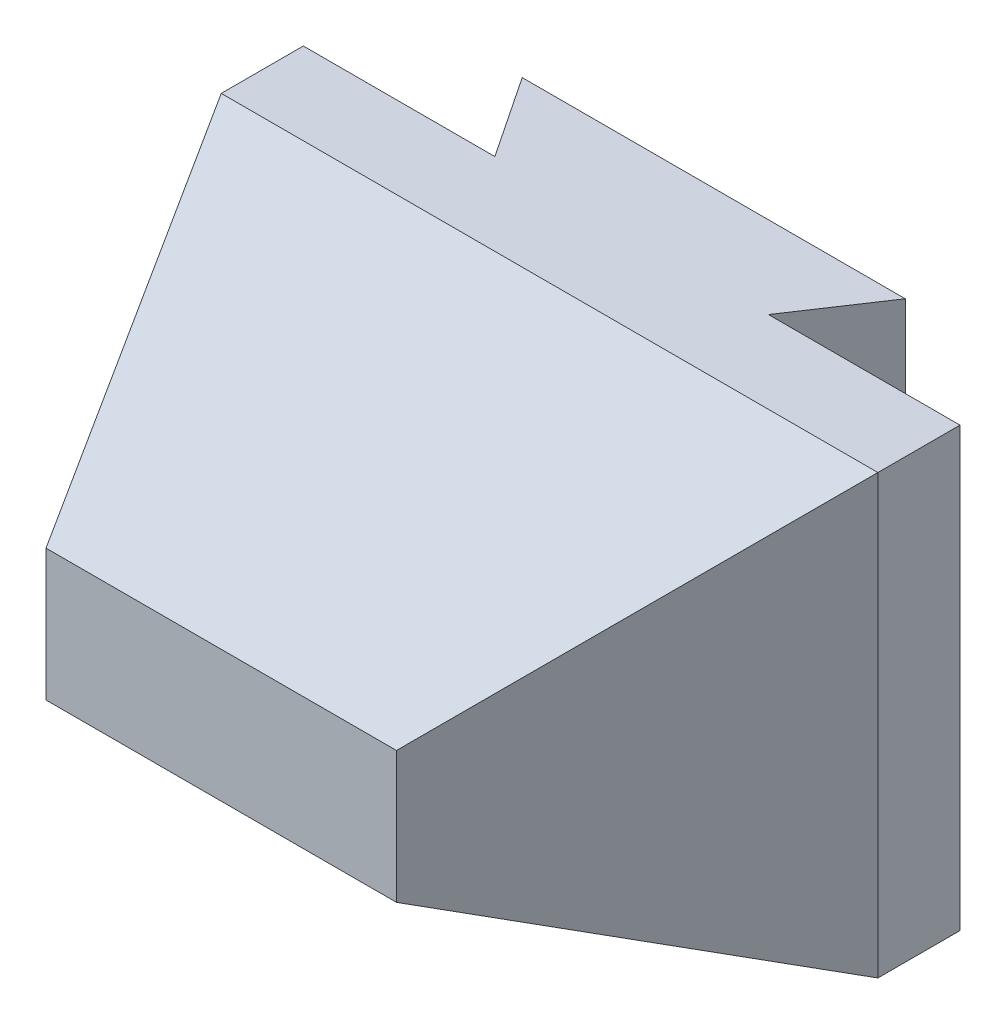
ISO-10303-21;
HEADER;
FILE_DESCRIPTION(('STEP AP214'),'2;1');
FILE_NAME('part.step','',(''),(''),'','','');
FILE_SCHEMA(('AUTOMOTIVE_DESIGN { 1 0 10303 214 1 1 1 1 }'));
ENDSEC;
DATA;
#1=APPLICATION_CONTEXT('core data for automotive mechanical design processes');
#2=APPLICATION_PROTOCOL_DEFINITION('international standard','automotive_design',2000,#1);
#3=PRODUCT_CONTEXT('',#1,'mechanical');
#4=PRODUCT('Part','Part','',(#3));
#5=PRODUCT_RELATED_PRODUCT_CATEGORY('part','',(#4));
#6=PRODUCT_DEFINITION_FORMATION('','',#4);
#7=PRODUCT_DEFINITION_CONTEXT('part definition',#1,'design');
#8=PRODUCT_DEFINITION('design','',#6,#7);
#9=PRODUCT_DEFINITION_SHAPE('','',#8);
#10=(LENGTH_UNIT() NAMED_UNIT(*) SI_UNIT(.MILLI.,.METRE.));
#11=(NAMED_UNIT(*) PLANE_ANGLE_UNIT() SI_UNIT($,.RADIAN.));
#12=(NAMED_UNIT(*) SI_UNIT($,.STERADIAN.) SOLID_ANGLE_UNIT());
#13=UNCERTAINTY_MEASURE_WITH_UNIT(LENGTH_MEASURE(1.E-05),#10,'distance_accuracy_value','');
#14=(GEOMETRIC_REPRESENTATION_CONTEXT(3) GLOBAL_UNCERTAINTY_ASSIGNED_CONTEXT((#13)) GLOBAL_UNIT_ASSIGNED_CONTEXT((#10,
#11,#12)) REPRESENTATION_CONTEXT('',''));
#15=CARTESIAN_POINT('',(0.,0.,0.));
#16=DIRECTION('',(0.,0.,1.));
#17=DIRECTION('',(1.,0.,0.));
#18=AXIS2_PLACEMENT_3D('',#15,#16,#17);
#19=CARTESIAN_POINT('',(60.,-40.,-30.));
#20=DIRECTION('',(0.,1.,0.));
#21=DIRECTION('',(-1.,0.,0.));
#22=AXIS2_PLACEMENT_3D('',#19,#20,#21);
#23=PLANE('',#22);
#24=DIRECTION('',(-1.,0.,0.));
#25=VECTOR('',#24,1.);
#26=CARTESIAN_POINT('',(60.,-40.0000000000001,-15.));
#27=LINE('',#26,#25);
#28=CARTESIAN_POINT('',(60.,-40.0000000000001,-15.));
#29=VERTEX_POINT('',#28);
#30=CARTESIAN_POINT('',(25.,-40.,-15.));
#31=VERTEX_POINT('',#30);
#32=EDGE_CURVE('E111',#29,#31,#27,.T.);
#33=ORIENTED_EDGE('',*,*,#32,.F.);
#34=DIRECTION('',(0.,0.,1.));
#35=VECTOR('',#34,1.);
#36=CARTESIAN_POINT('',(60.,-40.,-30.));
#37=LINE('',#36,#35);
#38=CARTESIAN_POINT('',(60.,-40.,0.));
#39=VERTEX_POINT('',#38);
#40=EDGE_CURVE('E155',#29,#39,#37,.T.);
#41=ORIENTED_EDGE('',*,*,#40,.T.);
#42=DIRECTION('',(1.,0.,0.));
#43=VECTOR('',#42,1.);
#44=CARTESIAN_POINT('',(-60.,-40.,0.));
#45=LINE('',#44,#43);
#46=CARTESIAN_POINT('',(-60.,-40.,0.));
#47=VERTEX_POINT('',#46);
#48=EDGE_CURVE('E166',#47,#39,#45,.T.);
#49=ORIENTED_EDGE('',*,*,#48,.F.);
#50=DIRECTION('',(0.,0.,1.));
#51=VECTOR('',#50,1.);
#52=CARTESIAN_POINT('',(-60.,-40.,-30.));
#53=LINE('',#52,#51);
#54=CARTESIAN_POINT('',(-60.,-40.,-15.));
#55=VERTEX_POINT('',#54);
#56=EDGE_CURVE('E161',#55,#47,#53,.T.);
#57=ORIENTED_EDGE('',*,*,#56,.F.);
#58=DIRECTION('',(1.,0.,0.));
#59=VECTOR('',#58,1.);
#60=CARTESIAN_POINT('',(-60.,-40.,-15.));
#61=LINE('',#60,#59);
#62=CARTESIAN_POINT('',(-25.,-40.,-15.));
#63=VERTEX_POINT('',#62);
#64=EDGE_CURVE('E137',#55,#63,#61,.T.);
#65=ORIENTED_EDGE('',*,*,#64,.T.);
#66=DIRECTION('',(-0.554700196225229,0.,-0.832050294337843));
#67=VECTOR('',#66,1.);
#68=CARTESIAN_POINT('',(-25.,-40.,-15.));
#69=LINE('',#68,#67);
#70=CARTESIAN_POINT('',(-35.,-40.,-30.));
#71=VERTEX_POINT('',#70);
#72=EDGE_CURVE('E140',#63,#71,#69,.T.);
#73=ORIENTED_EDGE('',*,*,#72,.T.);
#74=DIRECTION('',(-1.,0.,0.));
#75=VECTOR('',#74,1.);
#76=CARTESIAN_POINT('',(60.,-40.,-30.));
#77=LINE('',#76,#75);
#78=CARTESIAN_POINT('',(35.,-40.,-30.));
#79=VERTEX_POINT('',#78);
#80=EDGE_CURVE('E128',#79,#71,#77,.T.);
#81=ORIENTED_EDGE('',*,*,#80,.F.);
#82=DIRECTION('',(0.554700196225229,0.,-0.832050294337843));
#83=VECTOR('',#82,1.);
#84=CARTESIAN_POINT('',(25.,-40.,-15.));
#85=LINE('',#84,#83);
#86=EDGE_CURVE('E48',#31,#79,#85,.T.);
#87=ORIENTED_EDGE('',*,*,#86,.F.);
#88=EDGE_LOOP('',(#33,#41,#49,#57,#65,#73,#81,#87));
#89=FACE_BOUND('',#88,.T.);
#90=ADVANCED_FACE('F31',(#89),#23,.F.);
#91=CARTESIAN_POINT('',(-60.,40.,-30.));
#92=DIRECTION('',(0.,-1.,0.));
#93=DIRECTION('',(1.,0.,0.));
#94=AXIS2_PLACEMENT_3D('',#91,#92,#93);
#95=PLANE('',#94);
#96=DIRECTION('',(-1.,0.,0.));
#97=VECTOR('',#96,1.);
#98=CARTESIAN_POINT('',(60.,40.,-15.));
#99=LINE('',#98,#97);
#100=CARTESIAN_POINT('',(60.,40.,-15.));
#101=VERTEX_POINT('',#100);
#102=CARTESIAN_POINT('',(25.,40.,-15.));
#103=VERTEX_POINT('',#102);
#104=EDGE_CURVE('E129',#101,#103,#99,.T.);
#105=ORIENTED_EDGE('',*,*,#104,.T.);
#106=DIRECTION('',(0.554700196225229,0.,-0.832050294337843));
#107=VECTOR('',#106,1.);
#108=CARTESIAN_POINT('',(25.,40.,-15.));
#109=LINE('',#108,#107);
#110=CARTESIAN_POINT('',(35.,40.,-30.));
#111=VERTEX_POINT('',#110);
#112=EDGE_CURVE('E123',#103,#111,#109,.T.);
#113=ORIENTED_EDGE('',*,*,#112,.T.);
#114=DIRECTION('',(1.,0.,0.));
#115=VECTOR('',#114,1.);
#116=CARTESIAN_POINT('',(-60.,40.,-30.));
#117=LINE('',#116,#115);
#118=CARTESIAN_POINT('',(-35.,40.,-30.));
#119=VERTEX_POINT('',#118);
#120=EDGE_CURVE('E152',#119,#111,#117,.T.);
#121=ORIENTED_EDGE('',*,*,#120,.F.);
#122=DIRECTION('',(-0.554700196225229,0.,-0.832050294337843));
#123=VECTOR('',#122,1.);
#124=CARTESIAN_POINT('',(-25.,40.,-15.));
#125=LINE('',#124,#123);
#126=CARTESIAN_POINT('',(-25.,40.,-15.));
#127=VERTEX_POINT('',#126);
#128=EDGE_CURVE('E56',#127,#119,#125,.T.);
#129=ORIENTED_EDGE('',*,*,#128,.F.);
#130=DIRECTION('',(1.,0.,0.));
#131=VECTOR('',#130,1.);
#132=CARTESIAN_POINT('',(-60.,40.,-15.));
#133=LINE('',#132,#131);
#134=CARTESIAN_POINT('',(-60.,40.,-15.));
#135=VERTEX_POINT('',#134);
#136=EDGE_CURVE('E134',#135,#127,#133,.T.);
#137=ORIENTED_EDGE('',*,*,#136,.F.);
#138=DIRECTION('',(0.,0.,1.));
#139=VECTOR('',#138,1.);
#140=CARTESIAN_POINT('',(-60.,40.,-30.));
#141=LINE('',#140,#139);
#142=CARTESIAN_POINT('',(-60.,40.,0.));
#143=VERTEX_POINT('',#142);
#144=EDGE_CURVE('E159',#135,#143,#141,.T.);
#145=ORIENTED_EDGE('',*,*,#144,.T.);
#146=DIRECTION('',(-1.,0.,0.));
#147=VECTOR('',#146,1.);
#148=CARTESIAN_POINT('',(-60.,40.,0.));
#149=LINE('',#148,#147);
#150=CARTESIAN_POINT('',(60.,40.,0.));
#151=VERTEX_POINT('',#150);
#152=EDGE_CURVE('E172',#151,#143,#149,.T.);
#153=ORIENTED_EDGE('',*,*,#152,.F.);
#154=DIRECTION('',(0.,0.,1.));
#155=VECTOR('',#154,1.);
#156=CARTESIAN_POINT('',(60.,40.,-30.));
#157=LINE('',#156,#155);
#158=EDGE_CURVE('E157',#101,#151,#157,.T.);
#159=ORIENTED_EDGE('',*,*,#158,.F.);
#160=EDGE_LOOP('',(#105,#113,#121,#129,#137,#145,#153,#159));
#161=FACE_BOUND('',#160,.T.);
#162=ADVANCED_FACE('F212',(#161),#95,.F.);
#163=CARTESIAN_POINT('',(60.,40.,-30.));
#164=DIRECTION('',(-1.,0.,0.));
#165=DIRECTION('',(0.,0.,1.));
#166=AXIS2_PLACEMENT_3D('',#163,#164,#165);
#167=PLANE('',#166);
#168=DIRECTION('',(0.,1.,0.));
#169=VECTOR('',#168,1.);
#170=CARTESIAN_POINT('',(60.,-40.0000000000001,-15.));
#171=LINE('',#170,#169);
#172=EDGE_CURVE('E116',#29,#101,#171,.T.);
#173=ORIENTED_EDGE('',*,*,#172,.T.);
#174=ORIENTED_EDGE('',*,*,#158,.T.);
#175=DIRECTION('',(0.,1.,0.));
#176=VECTOR('',#175,1.);
#177=CARTESIAN_POINT('',(60.,40.,0.));
#178=LINE('',#177,#176);
#179=EDGE_CURVE('E169',#39,#151,#178,.T.);
#180=ORIENTED_EDGE('',*,*,#179,.F.);
#181=ORIENTED_EDGE('',*,*,#40,.F.);
#182=EDGE_LOOP('',(#173,#174,#180,#181));
#183=FACE_BOUND('',#182,.T.);
#184=ADVANCED_FACE('F209',(#183),#167,.F.);
#185=CARTESIAN_POINT('',(-60.,-40.,-30.));
#186=DIRECTION('',(0.,0.,-1.));
#187=DIRECTION('',(-1.,0.,0.));
#188=AXIS2_PLACEMENT_3D('',#185,#186,#187);
#189=PLANE('',#188);
#190=ORIENTED_EDGE('',*,*,#120,.T.);
#191=DIRECTION('',(0.,1.,0.));
#192=VECTOR('',#191,1.);
#193=CARTESIAN_POINT('',(35.,-40.,-30.));
#194=LINE('',#193,#192);
#195=EDGE_CURVE('E119',#79,#111,#194,.T.);
#196=ORIENTED_EDGE('',*,*,#195,.F.);
#197=ORIENTED_EDGE('',*,*,#80,.T.);
#198=DIRECTION('',(0.,1.,0.));
#199=VECTOR('',#198,1.);
#200=CARTESIAN_POINT('',(-35.,-40.,-30.));
#201=LINE('',#200,#199);
#202=EDGE_CURVE('E146',#71,#119,#201,.T.);
#203=ORIENTED_EDGE('',*,*,#202,.T.);
#204=EDGE_LOOP('',(#190,#196,#197,#203));
#205=FACE_BOUND('',#204,.T.);
#206=ADVANCED_FACE('F225',(#205),#189,.T.);
#207=CARTESIAN_POINT('',(-60.,40.,0.));
#208=DIRECTION('',(-0.90630778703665,0.,0.4226182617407));
#209=DIRECTION('',(0.4226182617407,0.,0.90630778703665));
#210=AXIS2_PLACEMENT_3D('',#207,#208,#209);
#211=PLANE('',#210);
#212=DIRECTION('',(0.,-1.,0.));
#213=VECTOR('',#212,1.);
#214=CARTESIAN_POINT('',(-60.,40.,0.));
#215=LINE('',#214,#213);
#216=EDGE_CURVE('E163',#143,#47,#215,.T.);
#217=ORIENTED_EDGE('',*,*,#216,.T.);
#218=DIRECTION('',(-0.389281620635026,-0.389281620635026,-0.834817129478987));
#219=VECTOR('',#218,1.);
#220=CARTESIAN_POINT('',(-60.,-40.,0.));
#221=LINE('',#220,#219);
#222=CARTESIAN_POINT('',(-32.0215405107,-12.0215405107,60.));
#223=VERTEX_POINT('',#222);
#224=EDGE_CURVE('E11',#223,#47,#221,.T.);
#225=ORIENTED_EDGE('',*,*,#224,.F.);
#226=DIRECTION('',(0.,1.,0.));
#227=VECTOR('',#226,1.);
#228=CARTESIAN_POINT('',(-32.0215405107,40.,60.));
#229=LINE('',#228,#227);
#230=CARTESIAN_POINT('',(-32.0215405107,12.0215405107,60.));
#231=VERTEX_POINT('',#230);
#232=EDGE_CURVE('E174',#231,#223,#229,.F.);
#233=ORIENTED_EDGE('',*,*,#232,.F.);
#234=DIRECTION('',(-0.389281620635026,0.389281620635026,-0.834817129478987));
#235=VECTOR('',#234,1.);
#236=CARTESIAN_POINT('',(-60.,40.,0.));
#237=LINE('',#236,#235);
#238=EDGE_CURVE('E176',#231,#143,#237,.T.);
#239=ORIENTED_EDGE('',*,*,#238,.T.);
#240=EDGE_LOOP('',(#217,#225,#233,#239));
#241=FACE_BOUND('',#240,.T.);
#242=ADVANCED_FACE('F200',(#241),#211,.T.);
#243=CARTESIAN_POINT('',(-60.,-40.,0.));
#244=DIRECTION('',(0.,-0.90630778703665,0.4226182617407));
#245=DIRECTION('',(0.,-0.4226182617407,-0.90630778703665));
#246=AXIS2_PLACEMENT_3D('',#243,#244,#245);
#247=PLANE('',#246);
#248=ORIENTED_EDGE('',*,*,#48,.T.);
#249=DIRECTION('',(0.389281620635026,-0.389281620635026,-0.834817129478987));
#250=VECTOR('',#249,1.);
#251=CARTESIAN_POINT('',(47.8767855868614,-27.8767855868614,25.9983172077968));
#252=LINE('',#251,#250);
#253=CARTESIAN_POINT('',(32.0215405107,-12.0215405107,60.));
#254=VERTEX_POINT('',#253);
#255=EDGE_CURVE('E40',#254,#39,#252,.T.);
#256=ORIENTED_EDGE('',*,*,#255,.F.);
#257=DIRECTION('',(-1.,0.,0.));
#258=VECTOR('',#257,1.);
#259=CARTESIAN_POINT('',(-60.,-12.0215405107,60.));
#260=LINE('',#259,#258);
#261=EDGE_CURVE('E186',#223,#254,#260,.F.);
#262=ORIENTED_EDGE('',*,*,#261,.F.);
#263=ORIENTED_EDGE('',*,*,#224,.T.);
#264=EDGE_LOOP('',(#248,#256,#262,#263));
#265=FACE_BOUND('',#264,.T.);
#266=ADVANCED_FACE('F33',(#265),#247,.T.);
#267=CARTESIAN_POINT('',(60.,40.,0.));
#268=DIRECTION('',(0.90630778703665,0.,0.4226182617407));
#269=DIRECTION('',(0.4226182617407,0.,-0.90630778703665));
#270=AXIS2_PLACEMENT_3D('',#267,#268,#269);
#271=PLANE('',#270);
#272=ORIENTED_EDGE('',*,*,#179,.T.);
#273=DIRECTION('',(0.389281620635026,0.389281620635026,-0.834817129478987));
#274=VECTOR('',#273,1.);
#275=CARTESIAN_POINT('',(41.8151783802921,21.8151783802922,38.9974758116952));
#276=LINE('',#275,#274);
#277=CARTESIAN_POINT('',(32.0215405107,12.0215405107,60.));
#278=VERTEX_POINT('',#277);
#279=EDGE_CURVE('E179',#278,#151,#276,.T.);
#280=ORIENTED_EDGE('',*,*,#279,.F.);
#281=DIRECTION('',(0.,-1.,0.));
#282=VECTOR('',#281,1.);
#283=CARTESIAN_POINT('',(32.0215405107,40.,60.));
#284=LINE('',#283,#282);
#285=EDGE_CURVE('E187',#254,#278,#284,.F.);
#286=ORIENTED_EDGE('',*,*,#285,.F.);
#287=ORIENTED_EDGE('',*,*,#255,.T.);
#288=EDGE_LOOP('',(#272,#280,#286,#287));
#289=FACE_BOUND('',#288,.T.);
#290=ADVANCED_FACE('F206',(#289),#271,.T.);
#291=CARTESIAN_POINT('',(-60.,40.,0.));
#292=DIRECTION('',(0.,0.90630778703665,0.4226182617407));
#293=DIRECTION('',(0.,-0.4226182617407,0.90630778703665));
#294=AXIS2_PLACEMENT_3D('',#291,#292,#293);
#295=PLANE('',#294);
#296=ORIENTED_EDGE('',*,*,#152,.T.);
#297=ORIENTED_EDGE('',*,*,#238,.F.);
#298=DIRECTION('',(1.,0.,0.));
#299=VECTOR('',#298,1.);
#300=CARTESIAN_POINT('',(-60.,12.0215405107,60.));
#301=LINE('',#300,#299);
#302=EDGE_CURVE('E35',#278,#231,#301,.F.);
#303=ORIENTED_EDGE('',*,*,#302,.F.);
#304=ORIENTED_EDGE('',*,*,#279,.T.);
#305=EDGE_LOOP('',(#296,#297,#303,#304));
#306=FACE_BOUND('',#305,.T.);
#307=ADVANCED_FACE('F197',(#306),#295,.T.);
#308=CARTESIAN_POINT('',(-60.,-40.,60.));
#309=DIRECTION('',(0.,0.,1.));
#310=DIRECTION('',(1.,0.,0.));
#311=AXIS2_PLACEMENT_3D('',#308,#309,#310);
#312=PLANE('',#311);
#313=ORIENTED_EDGE('',*,*,#232,.T.);
#314=ORIENTED_EDGE('',*,*,#261,.T.);
#315=ORIENTED_EDGE('',*,*,#285,.T.);
#316=ORIENTED_EDGE('',*,*,#302,.T.);
#317=EDGE_LOOP('',(#313,#314,#315,#316));
#318=FACE_BOUND('',#317,.T.);
#319=ADVANCED_FACE('F193',(#318),#312,.T.);
#320=CARTESIAN_POINT('',(-60.,-40.,-30.));
#321=DIRECTION('',(1.,0.,0.));
#322=DIRECTION('',(0.,0.,-1.));
#323=AXIS2_PLACEMENT_3D('',#320,#321,#322);
#324=PLANE('',#323);
#325=ORIENTED_EDGE('',*,*,#144,.F.);
#326=DIRECTION('',(0.,1.,0.));
#327=VECTOR('',#326,1.);
#328=CARTESIAN_POINT('',(-60.,-40.,-15.));
#329=LINE('',#328,#327);
#330=EDGE_CURVE('E142',#55,#135,#329,.T.);
#331=ORIENTED_EDGE('',*,*,#330,.F.);
#332=ORIENTED_EDGE('',*,*,#56,.T.);
#333=ORIENTED_EDGE('',*,*,#216,.F.);
#334=EDGE_LOOP('',(#325,#331,#332,#333));
#335=FACE_BOUND('',#334,.T.);
#336=ADVANCED_FACE('F217',(#335),#324,.F.);
#337=CARTESIAN_POINT('',(-25.,-40.,-15.));
#338=DIRECTION('',(0.832050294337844,0.,-0.554700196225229));
#339=DIRECTION('',(-0.554700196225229,0.,-0.832050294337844));
#340=AXIS2_PLACEMENT_3D('',#337,#338,#339);
#341=PLANE('',#340);
#342=ORIENTED_EDGE('',*,*,#128,.T.);
#343=ORIENTED_EDGE('',*,*,#202,.F.);
#344=ORIENTED_EDGE('',*,*,#72,.F.);
#345=DIRECTION('',(0.,1.,0.));
#346=VECTOR('',#345,1.);
#347=CARTESIAN_POINT('',(-25.,-40.,-15.));
#348=LINE('',#347,#346);
#349=EDGE_CURVE('E148',#63,#127,#348,.T.);
#350=ORIENTED_EDGE('',*,*,#349,.T.);
#351=EDGE_LOOP('',(#342,#343,#344,#350));
#352=FACE_BOUND('',#351,.T.);
#353=ADVANCED_FACE('F222',(#352),#341,.F.);
#354=CARTESIAN_POINT('',(-60.,-40.,-15.));
#355=DIRECTION('',(0.,0.,1.));
#356=DIRECTION('',(1.,0.,0.));
#357=AXIS2_PLACEMENT_3D('',#354,#355,#356);
#358=PLANE('',#357);
#359=ORIENTED_EDGE('',*,*,#136,.T.);
#360=ORIENTED_EDGE('',*,*,#349,.F.);
#361=ORIENTED_EDGE('',*,*,#64,.F.);
#362=ORIENTED_EDGE('',*,*,#330,.T.);
#363=EDGE_LOOP('',(#359,#360,#361,#362));
#364=FACE_BOUND('',#363,.T.);
#365=ADVANCED_FACE('F221',(#364),#358,.F.);
#366=CARTESIAN_POINT('',(60.,-40.0000000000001,-15.));
#367=DIRECTION('',(0.,0.,-1.));
#368=DIRECTION('',(-1.,0.,0.));
#369=AXIS2_PLACEMENT_3D('',#366,#367,#368);
#370=PLANE('',#369);
#371=ORIENTED_EDGE('',*,*,#104,.F.);
#372=ORIENTED_EDGE('',*,*,#172,.F.);
#373=ORIENTED_EDGE('',*,*,#32,.T.);
#374=DIRECTION('',(0.,1.,0.));
#375=VECTOR('',#374,1.);
#376=CARTESIAN_POINT('',(25.,-40.,-15.));
#377=LINE('',#376,#375);
#378=EDGE_CURVE('E113',#31,#103,#377,.T.);
#379=ORIENTED_EDGE('',*,*,#378,.T.);
#380=EDGE_LOOP('',(#371,#372,#373,#379));
#381=FACE_BOUND('',#380,.T.);
#382=ADVANCED_FACE('F112',(#381),#370,.T.);
#383=CARTESIAN_POINT('',(25.,-40.,-15.));
#384=DIRECTION('',(0.832050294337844,0.,0.554700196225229));
#385=DIRECTION('',(0.554700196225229,0.,-0.832050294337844));
#386=AXIS2_PLACEMENT_3D('',#383,#384,#385);
#387=PLANE('',#386);
#388=ORIENTED_EDGE('',*,*,#112,.F.);
#389=ORIENTED_EDGE('',*,*,#378,.F.);
#390=ORIENTED_EDGE('',*,*,#86,.T.);
#391=ORIENTED_EDGE('',*,*,#195,.T.);
#392=EDGE_LOOP('',(#388,#389,#390,#391));
#393=FACE_BOUND('',#392,.T.);
#394=ADVANCED_FACE('F121',(#393),#387,.T.);
#395=CLOSED_SHELL('',(#90,#162,#184,#206,#242,#266,#290,#307,#319,#336,#353,#365,#382,#394));
#396=MANIFOLD_SOLID_BREP('B2',#395);
#397=ADVANCED_BREP_SHAPE_REPRESENTATION('',(#18,#396),#14);
#398=SHAPE_DEFINITION_REPRESENTATION(#9,#397);
ENDSEC;
END-ISO-10303-21;
